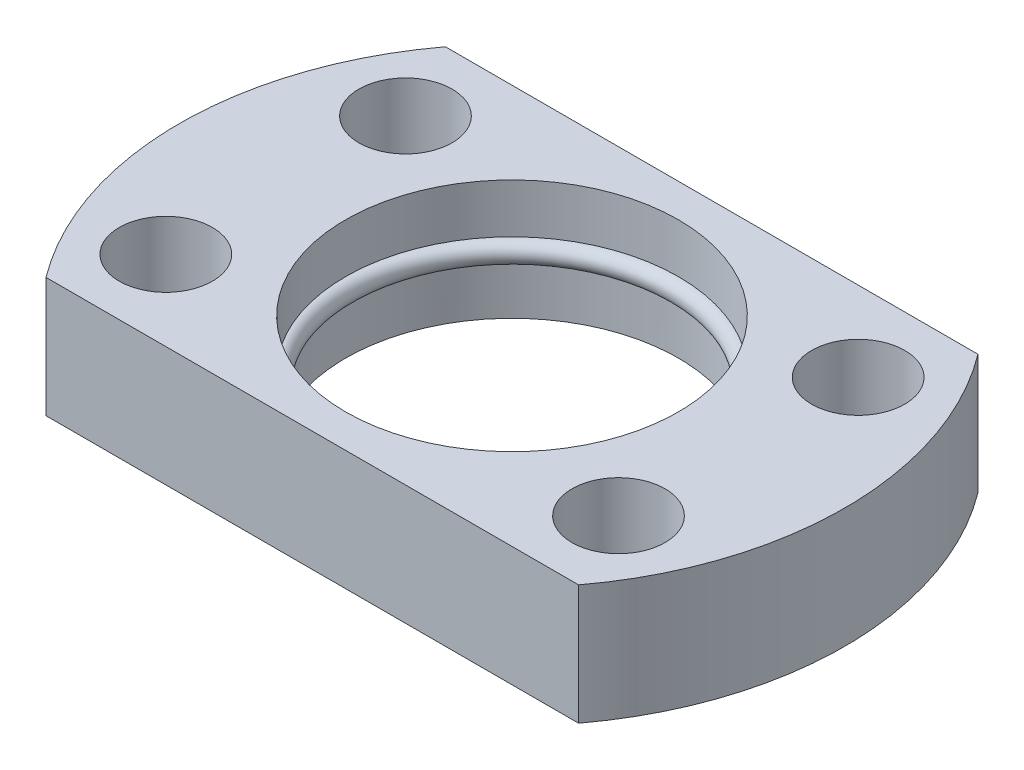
ISO-10303-21;
HEADER;
FILE_DESCRIPTION(('STEP AP214'),'2;1');
FILE_NAME('part.step','',(''),(''),'','','');
FILE_SCHEMA(('AUTOMOTIVE_DESIGN { 1 0 10303 214 1 1 1 1 }'));
ENDSEC;
DATA;
#1=APPLICATION_CONTEXT('core data for automotive mechanical design processes');
#2=APPLICATION_PROTOCOL_DEFINITION('international standard','automotive_design',2000,#1);
#3=PRODUCT_CONTEXT('',#1,'mechanical');
#4=PRODUCT('Part','Part','',(#3));
#5=PRODUCT_RELATED_PRODUCT_CATEGORY('part','',(#4));
#6=PRODUCT_DEFINITION_FORMATION('','',#4);
#7=PRODUCT_DEFINITION_CONTEXT('part definition',#1,'design');
#8=PRODUCT_DEFINITION('design','',#6,#7);
#9=PRODUCT_DEFINITION_SHAPE('','',#8);
#10=(LENGTH_UNIT() NAMED_UNIT(*) SI_UNIT(.MILLI.,.METRE.));
#11=(NAMED_UNIT(*) PLANE_ANGLE_UNIT() SI_UNIT($,.RADIAN.));
#12=(NAMED_UNIT(*) SI_UNIT($,.STERADIAN.) SOLID_ANGLE_UNIT());
#13=UNCERTAINTY_MEASURE_WITH_UNIT(LENGTH_MEASURE(1.E-05),#10,'distance_accuracy_value','');
#14=(GEOMETRIC_REPRESENTATION_CONTEXT(3) GLOBAL_UNCERTAINTY_ASSIGNED_CONTEXT((#13)) GLOBAL_UNIT_ASSIGNED_CONTEXT((#10,
#11,#12)) REPRESENTATION_CONTEXT('',''));
#15=CARTESIAN_POINT('',(0.,0.,0.));
#16=DIRECTION('',(0.,0.,1.));
#17=DIRECTION('',(1.,0.,0.));
#18=AXIS2_PLACEMENT_3D('',#15,#16,#17);
#19=CARTESIAN_POINT('',(0.,4.5,0.));
#20=DIRECTION('',(0.,-1.,0.));
#21=DIRECTION('',(0.,0.,-1.));
#22=AXIS2_PLACEMENT_3D('',#19,#20,#21);
#23=CYLINDRICAL_SURFACE('',#22,12.5);
#24=CARTESIAN_POINT('',(0.,-4.5,0.));
#25=DIRECTION('',(0.,1.,0.));
#26=DIRECTION('',(0.,0.,1.));
#27=AXIS2_PLACEMENT_3D('',#24,#25,#26);
#28=CIRCLE('',#27,12.5);
#29=CARTESIAN_POINT('',(0.,-4.5,12.5));
#30=VERTEX_POINT('',#29);
#31=EDGE_CURVE('E143',#30,#30,#28,.T.);
#32=ORIENTED_EDGE('',*,*,#31,.F.);
#33=EDGE_LOOP('',(#32));
#34=FACE_BOUND('',#33,.T.);
#35=CARTESIAN_POINT('',(0.,-0.800000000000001,0.));
#36=DIRECTION('',(0.,1.,0.));
#37=DIRECTION('',(0.,0.,1.));
#38=AXIS2_PLACEMENT_3D('',#35,#36,#37);
#39=CIRCLE('',#38,12.5);
#40=CARTESIAN_POINT('',(0.,-0.800000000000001,12.5));
#41=VERTEX_POINT('',#40);
#42=EDGE_CURVE('E39',#41,#41,#39,.T.);
#43=ORIENTED_EDGE('',*,*,#42,.T.);
#44=EDGE_LOOP('',(#43));
#45=FACE_BOUND('',#44,.T.);
#46=ADVANCED_FACE('F35',(#34,#45),#23,.F.);
#47=CARTESIAN_POINT('',(0.,4.5,0.));
#48=DIRECTION('',(0.,1.,0.));
#49=DIRECTION('',(0.,0.,1.));
#50=AXIS2_PLACEMENT_3D('',#47,#48,#49);
#51=CIRCLE('',#50,12.5);
#52=CARTESIAN_POINT('',(0.,4.5,12.5));
#53=VERTEX_POINT('',#52);
#54=EDGE_CURVE('E106',#53,#53,#51,.T.);
#55=ORIENTED_EDGE('',*,*,#54,.T.);
#56=EDGE_LOOP('',(#55));
#57=FACE_BOUND('',#56,.T.);
#58=CARTESIAN_POINT('',(0.,0.800000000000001,0.));
#59=DIRECTION('',(0.,-1.,0.));
#60=DIRECTION('',(0.,0.,-1.));
#61=AXIS2_PLACEMENT_3D('',#58,#59,#60);
#62=CIRCLE('',#61,12.5);
#63=CARTESIAN_POINT('',(0.,0.800000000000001,-12.5));
#64=VERTEX_POINT('',#63);
#65=EDGE_CURVE('E111',#64,#64,#62,.T.);
#66=ORIENTED_EDGE('',*,*,#65,.T.);
#67=EDGE_LOOP('',(#66));
#68=FACE_BOUND('',#67,.T.);
#69=ADVANCED_FACE('F155',(#57,#68),#23,.F.);
#70=CARTESIAN_POINT('',(0.,4.5,0.));
#71=DIRECTION('',(0.,1.,0.));
#72=DIRECTION('',(0.,0.,1.));
#73=AXIS2_PLACEMENT_3D('',#70,#71,#72);
#74=PLANE('',#73);
#75=CARTESIAN_POINT('',(17.,4.5,9.));
#76=DIRECTION('',(0.,1.,0.));
#77=DIRECTION('',(0.,0.,1.));
#78=AXIS2_PLACEMENT_3D('',#75,#76,#77);
#79=CIRCLE('',#78,3.5);
#80=CARTESIAN_POINT('',(17.,4.5,12.5));
#81=VERTEX_POINT('',#80);
#82=EDGE_CURVE('E128',#81,#81,#79,.T.);
#83=ORIENTED_EDGE('',*,*,#82,.F.);
#84=EDGE_LOOP('',(#83));
#85=FACE_BOUND('',#84,.T.);
#86=CARTESIAN_POINT('',(-17.,4.5,-9.));
#87=DIRECTION('',(0.,1.,0.));
#88=DIRECTION('',(0.,0.,1.));
#89=AXIS2_PLACEMENT_3D('',#86,#87,#88);
#90=CIRCLE('',#89,3.5);
#91=CARTESIAN_POINT('',(-17.,4.5,-5.5));
#92=VERTEX_POINT('',#91);
#93=EDGE_CURVE('E140',#92,#92,#90,.T.);
#94=ORIENTED_EDGE('',*,*,#93,.F.);
#95=EDGE_LOOP('',(#94));
#96=FACE_BOUND('',#95,.T.);
#97=CARTESIAN_POINT('',(0.,4.5,0.));
#98=DIRECTION('',(0.,1.,0.));
#99=DIRECTION('',(0.,0.,1.));
#100=AXIS2_PLACEMENT_3D('',#97,#98,#99);
#101=CIRCLE('',#100,25.);
#102=CARTESIAN_POINT('',(20.,4.5,15.));
#103=VERTEX_POINT('',#102);
#104=CARTESIAN_POINT('',(20.,4.5,-15.));
#105=VERTEX_POINT('',#104);
#106=EDGE_CURVE('E90',#103,#105,#101,.T.);
#107=ORIENTED_EDGE('',*,*,#106,.T.);
#108=DIRECTION('',(-1.,0.,0.));
#109=VECTOR('',#108,1.);
#110=CARTESIAN_POINT('',(-20.,4.5,-15.));
#111=LINE('',#110,#109);
#112=CARTESIAN_POINT('',(-20.,4.5,-15.));
#113=VERTEX_POINT('',#112);
#114=EDGE_CURVE('E84',#105,#113,#111,.T.);
#115=ORIENTED_EDGE('',*,*,#114,.T.);
#116=CARTESIAN_POINT('',(0.,4.5,0.));
#117=DIRECTION('',(0.,1.,0.));
#118=DIRECTION('',(0.,0.,1.));
#119=AXIS2_PLACEMENT_3D('',#116,#117,#118);
#120=CIRCLE('',#119,25.);
#121=CARTESIAN_POINT('',(-20.,4.5,15.));
#122=VERTEX_POINT('',#121);
#123=EDGE_CURVE('E88',#113,#122,#120,.T.);
#124=ORIENTED_EDGE('',*,*,#123,.T.);
#125=DIRECTION('',(1.,0.,0.));
#126=VECTOR('',#125,1.);
#127=CARTESIAN_POINT('',(-20.,4.5,15.));
#128=LINE('',#127,#126);
#129=EDGE_CURVE('E54',#122,#103,#128,.T.);
#130=ORIENTED_EDGE('',*,*,#129,.T.);
#131=EDGE_LOOP('',(#107,#115,#124,#130));
#132=FACE_BOUND('',#131,.T.);
#133=ORIENTED_EDGE('',*,*,#54,.F.);
#134=EDGE_LOOP('',(#133));
#135=FACE_BOUND('',#134,.T.);
#136=CARTESIAN_POINT('',(-17.,4.5,9.));
#137=DIRECTION('',(0.,1.,0.));
#138=DIRECTION('',(0.,0.,1.));
#139=AXIS2_PLACEMENT_3D('',#136,#137,#138);
#140=CIRCLE('',#139,3.5);
#141=CARTESIAN_POINT('',(-17.,4.5,12.5));
#142=VERTEX_POINT('',#141);
#143=EDGE_CURVE('E134',#142,#142,#140,.T.);
#144=ORIENTED_EDGE('',*,*,#143,.F.);
#145=EDGE_LOOP('',(#144));
#146=FACE_BOUND('',#145,.T.);
#147=CARTESIAN_POINT('',(17.,4.5,-9.));
#148=DIRECTION('',(0.,1.,0.));
#149=DIRECTION('',(0.,0.,1.));
#150=AXIS2_PLACEMENT_3D('',#147,#148,#149);
#151=CIRCLE('',#150,3.5);
#152=CARTESIAN_POINT('',(17.,4.5,-5.5));
#153=VERTEX_POINT('',#152);
#154=EDGE_CURVE('E120',#153,#153,#151,.T.);
#155=ORIENTED_EDGE('',*,*,#154,.F.);
#156=EDGE_LOOP('',(#155));
#157=FACE_BOUND('',#156,.T.);
#158=ADVANCED_FACE('F85',(#85,#96,#132,#135,#146,#157),#74,.T.);
#159=CARTESIAN_POINT('',(0.,-4.5,0.));
#160=DIRECTION('',(0.,1.,0.));
#161=DIRECTION('',(0.,0.,1.));
#162=AXIS2_PLACEMENT_3D('',#159,#160,#161);
#163=PLANE('',#162);
#164=CARTESIAN_POINT('',(0.,-4.5,0.));
#165=DIRECTION('',(0.,1.,0.));
#166=DIRECTION('',(0.,0.,1.));
#167=AXIS2_PLACEMENT_3D('',#164,#165,#166);
#168=CIRCLE('',#167,25.);
#169=CARTESIAN_POINT('',(20.,-4.5,15.));
#170=VERTEX_POINT('',#169);
#171=CARTESIAN_POINT('',(20.,-4.5,-15.));
#172=VERTEX_POINT('',#171);
#173=EDGE_CURVE('E103',#170,#172,#168,.T.);
#174=ORIENTED_EDGE('',*,*,#173,.F.);
#175=DIRECTION('',(1.,0.,0.));
#176=VECTOR('',#175,1.);
#177=CARTESIAN_POINT('',(-20.,-4.5,15.));
#178=LINE('',#177,#176);
#179=CARTESIAN_POINT('',(-20.,-4.5,15.));
#180=VERTEX_POINT('',#179);
#181=EDGE_CURVE('E77',#180,#170,#178,.T.);
#182=ORIENTED_EDGE('',*,*,#181,.F.);
#183=CARTESIAN_POINT('',(0.,-4.5,0.));
#184=DIRECTION('',(0.,1.,0.));
#185=DIRECTION('',(0.,0.,1.));
#186=AXIS2_PLACEMENT_3D('',#183,#184,#185);
#187=CIRCLE('',#186,25.);
#188=CARTESIAN_POINT('',(-20.,-4.5,-15.));
#189=VERTEX_POINT('',#188);
#190=EDGE_CURVE('E71',#189,#180,#187,.T.);
#191=ORIENTED_EDGE('',*,*,#190,.F.);
#192=DIRECTION('',(-1.,0.,0.));
#193=VECTOR('',#192,1.);
#194=CARTESIAN_POINT('',(-20.,-4.5,-15.));
#195=LINE('',#194,#193);
#196=EDGE_CURVE('E94',#172,#189,#195,.T.);
#197=ORIENTED_EDGE('',*,*,#196,.F.);
#198=EDGE_LOOP('',(#174,#182,#191,#197));
#199=FACE_BOUND('',#198,.T.);
#200=ORIENTED_EDGE('',*,*,#31,.T.);
#201=EDGE_LOOP('',(#200));
#202=FACE_BOUND('',#201,.T.);
#203=CARTESIAN_POINT('',(-17.,-4.5,-9.));
#204=DIRECTION('',(0.,1.,0.));
#205=DIRECTION('',(0.,0.,1.));
#206=AXIS2_PLACEMENT_3D('',#203,#204,#205);
#207=CIRCLE('',#206,3.5);
#208=CARTESIAN_POINT('',(-17.,-4.5,-5.5));
#209=VERTEX_POINT('',#208);
#210=EDGE_CURVE('E137',#209,#209,#207,.T.);
#211=ORIENTED_EDGE('',*,*,#210,.T.);
#212=EDGE_LOOP('',(#211));
#213=FACE_BOUND('',#212,.T.);
#214=CARTESIAN_POINT('',(-17.,-4.5,9.));
#215=DIRECTION('',(0.,1.,0.));
#216=DIRECTION('',(0.,0.,1.));
#217=AXIS2_PLACEMENT_3D('',#214,#215,#216);
#218=CIRCLE('',#217,3.5);
#219=CARTESIAN_POINT('',(-17.,-4.5,12.5));
#220=VERTEX_POINT('',#219);
#221=EDGE_CURVE('E131',#220,#220,#218,.T.);
#222=ORIENTED_EDGE('',*,*,#221,.T.);
#223=EDGE_LOOP('',(#222));
#224=FACE_BOUND('',#223,.T.);
#225=CARTESIAN_POINT('',(17.,-4.5,9.));
#226=DIRECTION('',(0.,1.,0.));
#227=DIRECTION('',(0.,0.,1.));
#228=AXIS2_PLACEMENT_3D('',#225,#226,#227);
#229=CIRCLE('',#228,3.5);
#230=CARTESIAN_POINT('',(17.,-4.5,12.5));
#231=VERTEX_POINT('',#230);
#232=EDGE_CURVE('E125',#231,#231,#229,.T.);
#233=ORIENTED_EDGE('',*,*,#232,.T.);
#234=EDGE_LOOP('',(#233));
#235=FACE_BOUND('',#234,.T.);
#236=CARTESIAN_POINT('',(17.,-4.5,-9.));
#237=DIRECTION('',(0.,1.,0.));
#238=DIRECTION('',(0.,0.,1.));
#239=AXIS2_PLACEMENT_3D('',#236,#237,#238);
#240=CIRCLE('',#239,3.5);
#241=CARTESIAN_POINT('',(17.,-4.5,-5.5));
#242=VERTEX_POINT('',#241);
#243=EDGE_CURVE('E116',#242,#242,#240,.T.);
#244=ORIENTED_EDGE('',*,*,#243,.T.);
#245=EDGE_LOOP('',(#244));
#246=FACE_BOUND('',#245,.T.);
#247=ADVANCED_FACE('F151',(#199,#202,#213,#224,#235,#246),#163,.F.);
#248=CARTESIAN_POINT('',(0.,4.5,0.));
#249=DIRECTION('',(0.,-1.,0.));
#250=DIRECTION('',(0.,0.,-1.));
#251=AXIS2_PLACEMENT_3D('',#248,#249,#250);
#252=CYLINDRICAL_SURFACE('',#251,25.);
#253=ORIENTED_EDGE('',*,*,#173,.T.);
#254=DIRECTION('',(0.,-1.,0.));
#255=VECTOR('',#254,1.);
#256=CARTESIAN_POINT('',(20.,4.5,-15.));
#257=LINE('',#256,#255);
#258=EDGE_CURVE('E11',#105,#172,#257,.T.);
#259=ORIENTED_EDGE('',*,*,#258,.F.);
#260=ORIENTED_EDGE('',*,*,#106,.F.);
#261=DIRECTION('',(0.,-1.,0.));
#262=VECTOR('',#261,1.);
#263=CARTESIAN_POINT('',(20.,4.5,15.));
#264=LINE('',#263,#262);
#265=EDGE_CURVE('E99',#103,#170,#264,.T.);
#266=ORIENTED_EDGE('',*,*,#265,.T.);
#267=EDGE_LOOP('',(#253,#259,#260,#266));
#268=FACE_BOUND('',#267,.T.);
#269=ADVANCED_FACE('F37',(#268),#252,.T.);
#270=CARTESIAN_POINT('',(-20.,4.5,-15.));
#271=DIRECTION('',(0.,0.,1.));
#272=DIRECTION('',(1.,0.,0.));
#273=AXIS2_PLACEMENT_3D('',#270,#271,#272);
#274=PLANE('',#273);
#275=ORIENTED_EDGE('',*,*,#196,.T.);
#276=DIRECTION('',(0.,-1.,0.));
#277=VECTOR('',#276,1.);
#278=CARTESIAN_POINT('',(-20.,4.5,-15.));
#279=LINE('',#278,#277);
#280=EDGE_CURVE('E45',#113,#189,#279,.T.);
#281=ORIENTED_EDGE('',*,*,#280,.F.);
#282=ORIENTED_EDGE('',*,*,#114,.F.);
#283=ORIENTED_EDGE('',*,*,#258,.T.);
#284=EDGE_LOOP('',(#275,#281,#282,#283));
#285=FACE_BOUND('',#284,.T.);
#286=ADVANCED_FACE('F93',(#285),#274,.F.);
#287=CARTESIAN_POINT('',(0.,4.5,0.));
#288=DIRECTION('',(0.,-1.,0.));
#289=DIRECTION('',(0.,0.,-1.));
#290=AXIS2_PLACEMENT_3D('',#287,#288,#289);
#291=CYLINDRICAL_SURFACE('',#290,25.);
#292=ORIENTED_EDGE('',*,*,#190,.T.);
#293=DIRECTION('',(0.,-1.,0.));
#294=VECTOR('',#293,1.);
#295=CARTESIAN_POINT('',(-20.,4.5,15.));
#296=LINE('',#295,#294);
#297=EDGE_CURVE('E95',#122,#180,#296,.T.);
#298=ORIENTED_EDGE('',*,*,#297,.F.);
#299=ORIENTED_EDGE('',*,*,#123,.F.);
#300=ORIENTED_EDGE('',*,*,#280,.T.);
#301=EDGE_LOOP('',(#292,#298,#299,#300));
#302=FACE_BOUND('',#301,.T.);
#303=ADVANCED_FACE('F97',(#302),#291,.T.);
#304=CARTESIAN_POINT('',(-20.,4.5,15.));
#305=DIRECTION('',(0.,0.,-1.));
#306=DIRECTION('',(-1.,0.,0.));
#307=AXIS2_PLACEMENT_3D('',#304,#305,#306);
#308=PLANE('',#307);
#309=ORIENTED_EDGE('',*,*,#181,.T.);
#310=ORIENTED_EDGE('',*,*,#265,.F.);
#311=ORIENTED_EDGE('',*,*,#129,.F.);
#312=ORIENTED_EDGE('',*,*,#297,.T.);
#313=EDGE_LOOP('',(#309,#310,#311,#312));
#314=FACE_BOUND('',#313,.T.);
#315=ADVANCED_FACE('F171',(#314),#308,.F.);
#316=CARTESIAN_POINT('',(-17.,4.5,-9.));
#317=DIRECTION('',(0.,-1.,0.));
#318=DIRECTION('',(0.,0.,-1.));
#319=AXIS2_PLACEMENT_3D('',#316,#317,#318);
#320=CYLINDRICAL_SURFACE('',#319,3.5);
#321=ORIENTED_EDGE('',*,*,#93,.T.);
#322=EDGE_LOOP('',(#321));
#323=FACE_BOUND('',#322,.T.);
#324=ORIENTED_EDGE('',*,*,#210,.F.);
#325=EDGE_LOOP('',(#324));
#326=FACE_BOUND('',#325,.T.);
#327=ADVANCED_FACE('F163',(#323,#326),#320,.F.);
#328=CARTESIAN_POINT('',(-17.,4.5,9.));
#329=DIRECTION('',(0.,-1.,0.));
#330=DIRECTION('',(0.,0.,-1.));
#331=AXIS2_PLACEMENT_3D('',#328,#329,#330);
#332=CYLINDRICAL_SURFACE('',#331,3.5);
#333=ORIENTED_EDGE('',*,*,#143,.T.);
#334=EDGE_LOOP('',(#333));
#335=FACE_BOUND('',#334,.T.);
#336=ORIENTED_EDGE('',*,*,#221,.F.);
#337=EDGE_LOOP('',(#336));
#338=FACE_BOUND('',#337,.T.);
#339=ADVANCED_FACE('F224',(#335,#338),#332,.F.);
#340=CARTESIAN_POINT('',(17.,4.5,9.));
#341=DIRECTION('',(0.,-1.,0.));
#342=DIRECTION('',(0.,0.,-1.));
#343=AXIS2_PLACEMENT_3D('',#340,#341,#342);
#344=CYLINDRICAL_SURFACE('',#343,3.5);
#345=ORIENTED_EDGE('',*,*,#82,.T.);
#346=EDGE_LOOP('',(#345));
#347=FACE_BOUND('',#346,.T.);
#348=ORIENTED_EDGE('',*,*,#232,.F.);
#349=EDGE_LOOP('',(#348));
#350=FACE_BOUND('',#349,.T.);
#351=ADVANCED_FACE('F217',(#347,#350),#344,.F.);
#352=CARTESIAN_POINT('',(17.,4.5,-9.));
#353=DIRECTION('',(0.,-1.,0.));
#354=DIRECTION('',(0.,0.,-1.));
#355=AXIS2_PLACEMENT_3D('',#352,#353,#354);
#356=CYLINDRICAL_SURFACE('',#355,3.5);
#357=ORIENTED_EDGE('',*,*,#154,.T.);
#358=EDGE_LOOP('',(#357));
#359=FACE_BOUND('',#358,.T.);
#360=ORIENTED_EDGE('',*,*,#243,.F.);
#361=EDGE_LOOP('',(#360));
#362=FACE_BOUND('',#361,.T.);
#363=ADVANCED_FACE('F208',(#359,#362),#356,.F.);
#364=CARTESIAN_POINT('',(0.,0.,0.));
#365=DIRECTION('',(0.,-1.,0.));
#366=DIRECTION('',(0.,0.,-1.));
#367=AXIS2_PLACEMENT_3D('',#364,#365,#366);
#368=TOROIDAL_SURFACE('',#367,12.5,0.800000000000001);
#369=ORIENTED_EDGE('',*,*,#65,.F.);
#370=EDGE_LOOP('',(#369));
#371=FACE_BOUND('',#370,.T.);
#372=ORIENTED_EDGE('',*,*,#42,.F.);
#373=EDGE_LOOP('',(#372));
#374=FACE_BOUND('',#373,.T.);
#375=ADVANCED_FACE('F204',(#371,#374),#368,.T.);
#376=CLOSED_SHELL('',(#46,#69,#158,#247,#269,#286,#303,#315,#327,#339,#351,#363,#375));
#377=MANIFOLD_SOLID_BREP('B2',#376);
#378=ADVANCED_BREP_SHAPE_REPRESENTATION('',(#18,#377),#14);
#379=SHAPE_DEFINITION_REPRESENTATION(#9,#378);
ENDSEC;
END-ISO-10303-21;
